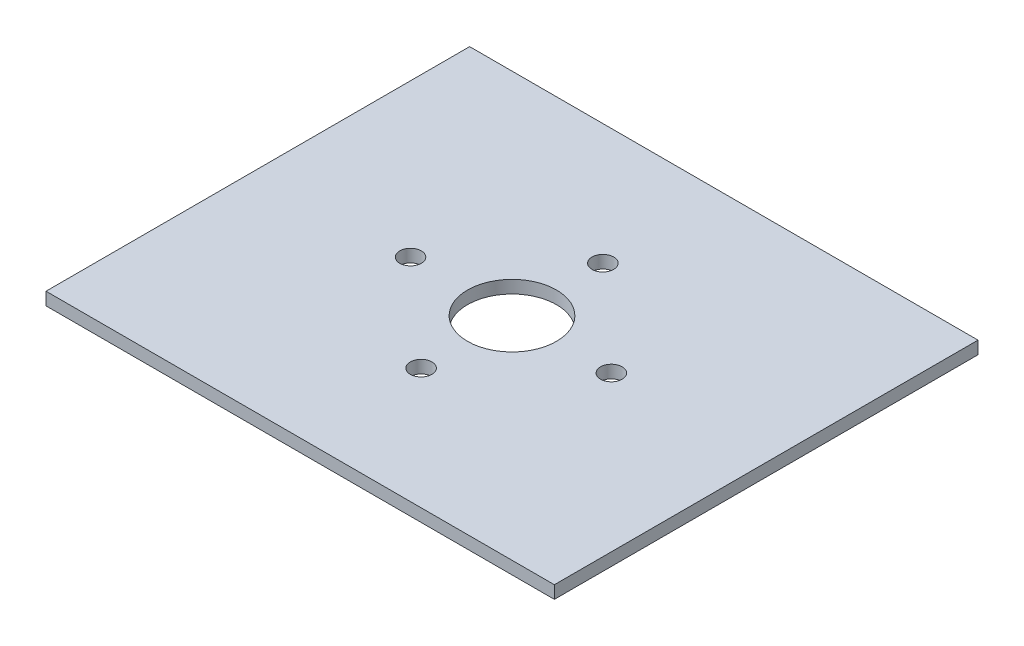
ISO-10303-21;
HEADER;
FILE_DESCRIPTION(('STEP AP214'),'2;1');
FILE_NAME('part.step','',(''),(''),'','','');
FILE_SCHEMA(('AUTOMOTIVE_DESIGN { 1 0 10303 214 1 1 1 1 }'));
ENDSEC;
DATA;
#1=APPLICATION_CONTEXT('core data for automotive mechanical design processes');
#2=APPLICATION_PROTOCOL_DEFINITION('international standard','automotive_design',2000,#1);
#3=PRODUCT_CONTEXT('',#1,'mechanical');
#4=PRODUCT('Part','Part','',(#3));
#5=PRODUCT_RELATED_PRODUCT_CATEGORY('part','',(#4));
#6=PRODUCT_DEFINITION_FORMATION('','',#4);
#7=PRODUCT_DEFINITION_CONTEXT('part definition',#1,'design');
#8=PRODUCT_DEFINITION('design','',#6,#7);
#9=PRODUCT_DEFINITION_SHAPE('','',#8);
#10=(LENGTH_UNIT() NAMED_UNIT(*) SI_UNIT(.MILLI.,.METRE.));
#11=(NAMED_UNIT(*) PLANE_ANGLE_UNIT() SI_UNIT($,.RADIAN.));
#12=(NAMED_UNIT(*) SI_UNIT($,.STERADIAN.) SOLID_ANGLE_UNIT());
#13=UNCERTAINTY_MEASURE_WITH_UNIT(LENGTH_MEASURE(1.E-05),#10,'distance_accuracy_value','');
#14=(GEOMETRIC_REPRESENTATION_CONTEXT(3) GLOBAL_UNCERTAINTY_ASSIGNED_CONTEXT((#13)) GLOBAL_UNIT_ASSIGNED_CONTEXT((#10,
#11,#12)) REPRESENTATION_CONTEXT('',''));
#15=CARTESIAN_POINT('',(0.,0.,0.));
#16=DIRECTION('',(0.,0.,1.));
#17=DIRECTION('',(1.,0.,0.));
#18=AXIS2_PLACEMENT_3D('',#15,#16,#17);
#19=CARTESIAN_POINT('',(0.,3.,0.));
#20=DIRECTION('',(0.,-1.,0.));
#21=DIRECTION('',(0.,0.,-1.));
#22=AXIS2_PLACEMENT_3D('',#19,#20,#21);
#23=PLANE('',#22);
#24=CARTESIAN_POINT('',(60.,3.,50.));
#25=DIRECTION('',(0.,1.,0.));
#26=DIRECTION('',(0.,0.,1.));
#27=AXIS2_PLACEMENT_3D('',#24,#25,#26);
#28=CIRCLE('',#27,10.5);
#29=CARTESIAN_POINT('',(60.,3.,60.5));
#30=VERTEX_POINT('',#29);
#31=EDGE_CURVE('E168',#30,#30,#28,.T.);
#32=ORIENTED_EDGE('',*,*,#31,.F.);
#33=EDGE_LOOP('',(#32));
#34=FACE_BOUND('',#33,.T.);
#35=DIRECTION('',(-1.,0.,0.));
#36=VECTOR('',#35,1.);
#37=CARTESIAN_POINT('',(0.,3.,0.));
#38=LINE('',#37,#36);
#39=CARTESIAN_POINT('',(120.,3.,0.));
#40=VERTEX_POINT('',#39);
#41=CARTESIAN_POINT('',(0.,3.,0.));
#42=VERTEX_POINT('',#41);
#43=EDGE_CURVE('E98',#40,#42,#38,.T.);
#44=ORIENTED_EDGE('',*,*,#43,.T.);
#45=DIRECTION('',(0.,0.,1.));
#46=VECTOR('',#45,1.);
#47=CARTESIAN_POINT('',(0.,3.,0.));
#48=LINE('',#47,#46);
#49=CARTESIAN_POINT('',(0.,3.,100.));
#50=VERTEX_POINT('',#49);
#51=EDGE_CURVE('E93',#42,#50,#48,.T.);
#52=ORIENTED_EDGE('',*,*,#51,.T.);
#53=DIRECTION('',(1.,0.,0.));
#54=VECTOR('',#53,1.);
#55=CARTESIAN_POINT('',(0.,3.,100.));
#56=LINE('',#55,#54);
#57=CARTESIAN_POINT('',(120.,3.,100.));
#58=VERTEX_POINT('',#57);
#59=EDGE_CURVE('E96',#50,#58,#56,.T.);
#60=ORIENTED_EDGE('',*,*,#59,.T.);
#61=DIRECTION('',(0.,0.,-1.));
#62=VECTOR('',#61,1.);
#63=CARTESIAN_POINT('',(120.,3.,0.));
#64=LINE('',#63,#62);
#65=EDGE_CURVE('E63',#58,#40,#64,.T.);
#66=ORIENTED_EDGE('',*,*,#65,.T.);
#67=EDGE_LOOP('',(#44,#52,#60,#66));
#68=FACE_BOUND('',#67,.T.);
#69=CARTESIAN_POINT('',(36.05,3.,50.));
#70=DIRECTION('',(0.,1.,0.));
#71=DIRECTION('',(0.,0.,1.));
#72=AXIS2_PLACEMENT_3D('',#69,#70,#71);
#73=CIRCLE('',#72,2.55000000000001);
#74=CARTESIAN_POINT('',(36.05,3.,52.55));
#75=VERTEX_POINT('',#74);
#76=EDGE_CURVE('E118',#75,#75,#73,.T.);
#77=ORIENTED_EDGE('',*,*,#76,.F.);
#78=EDGE_LOOP('',(#77));
#79=FACE_BOUND('',#78,.T.);
#80=CARTESIAN_POINT('',(83.45,3.,50.));
#81=DIRECTION('',(0.,1.,0.));
#82=DIRECTION('',(0.,0.,1.));
#83=AXIS2_PLACEMENT_3D('',#80,#81,#82);
#84=CIRCLE('',#83,2.54999999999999);
#85=CARTESIAN_POINT('',(83.45,3.,52.55));
#86=VERTEX_POINT('',#85);
#87=EDGE_CURVE('E140',#86,#86,#84,.T.);
#88=ORIENTED_EDGE('',*,*,#87,.F.);
#89=EDGE_LOOP('',(#88));
#90=FACE_BOUND('',#89,.T.);
#91=CARTESIAN_POINT('',(60.,3.,28.55));
#92=DIRECTION('',(0.,1.,0.));
#93=DIRECTION('',(0.,0.,1.));
#94=AXIS2_PLACEMENT_3D('',#91,#92,#93);
#95=CIRCLE('',#94,2.54999999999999);
#96=CARTESIAN_POINT('',(60.,3.,31.1));
#97=VERTEX_POINT('',#96);
#98=EDGE_CURVE('E148',#97,#97,#95,.T.);
#99=ORIENTED_EDGE('',*,*,#98,.F.);
#100=EDGE_LOOP('',(#99));
#101=FACE_BOUND('',#100,.T.);
#102=CARTESIAN_POINT('',(60.,3.,71.45));
#103=DIRECTION('',(0.,1.,0.));
#104=DIRECTION('',(0.,0.,1.));
#105=AXIS2_PLACEMENT_3D('',#102,#103,#104);
#106=CIRCLE('',#105,2.55);
#107=CARTESIAN_POINT('',(60.,3.,74.));
#108=VERTEX_POINT('',#107);
#109=EDGE_CURVE('E156',#108,#108,#106,.T.);
#110=ORIENTED_EDGE('',*,*,#109,.F.);
#111=EDGE_LOOP('',(#110));
#112=FACE_BOUND('',#111,.T.);
#113=ADVANCED_FACE('F45',(#34,#68,#79,#90,#101,#112),#23,.F.);
#114=CARTESIAN_POINT('',(0.,0.,0.));
#115=DIRECTION('',(0.,-1.,0.));
#116=DIRECTION('',(0.,0.,-1.));
#117=AXIS2_PLACEMENT_3D('',#114,#115,#116);
#118=PLANE('',#117);
#119=CARTESIAN_POINT('',(60.,0.,50.));
#120=DIRECTION('',(0.,1.,0.));
#121=DIRECTION('',(0.,0.,1.));
#122=AXIS2_PLACEMENT_3D('',#119,#120,#121);
#123=CIRCLE('',#122,10.5);
#124=CARTESIAN_POINT('',(60.,0.,60.5));
#125=VERTEX_POINT('',#124);
#126=EDGE_CURVE('E164',#125,#125,#123,.T.);
#127=ORIENTED_EDGE('',*,*,#126,.T.);
#128=EDGE_LOOP('',(#127));
#129=FACE_BOUND('',#128,.T.);
#130=CARTESIAN_POINT('',(60.,0.,28.55));
#131=DIRECTION('',(0.,1.,0.));
#132=DIRECTION('',(0.,0.,1.));
#133=AXIS2_PLACEMENT_3D('',#130,#131,#132);
#134=CIRCLE('',#133,2.54999999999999);
#135=CARTESIAN_POINT('',(60.,0.,31.1));
#136=VERTEX_POINT('',#135);
#137=EDGE_CURVE('E152',#136,#136,#134,.T.);
#138=ORIENTED_EDGE('',*,*,#137,.T.);
#139=EDGE_LOOP('',(#138));
#140=FACE_BOUND('',#139,.T.);
#141=CARTESIAN_POINT('',(36.05,0.,50.));
#142=DIRECTION('',(0.,1.,0.));
#143=DIRECTION('',(0.,0.,1.));
#144=AXIS2_PLACEMENT_3D('',#141,#142,#143);
#145=CIRCLE('',#144,2.55000000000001);
#146=CARTESIAN_POINT('',(36.05,0.,52.55));
#147=VERTEX_POINT('',#146);
#148=EDGE_CURVE('E136',#147,#147,#145,.T.);
#149=ORIENTED_EDGE('',*,*,#148,.T.);
#150=EDGE_LOOP('',(#149));
#151=FACE_BOUND('',#150,.T.);
#152=DIRECTION('',(-1.,0.,0.));
#153=VECTOR('',#152,1.);
#154=CARTESIAN_POINT('',(0.,0.,0.));
#155=LINE('',#154,#153);
#156=CARTESIAN_POINT('',(120.,0.,0.));
#157=VERTEX_POINT('',#156);
#158=CARTESIAN_POINT('',(0.,0.,0.));
#159=VERTEX_POINT('',#158);
#160=EDGE_CURVE('E114',#157,#159,#155,.T.);
#161=ORIENTED_EDGE('',*,*,#160,.F.);
#162=DIRECTION('',(0.,0.,-1.));
#163=VECTOR('',#162,1.);
#164=CARTESIAN_POINT('',(120.,0.,0.));
#165=LINE('',#164,#163);
#166=CARTESIAN_POINT('',(120.,0.,100.));
#167=VERTEX_POINT('',#166);
#168=EDGE_CURVE('E86',#167,#157,#165,.T.);
#169=ORIENTED_EDGE('',*,*,#168,.F.);
#170=DIRECTION('',(1.,0.,0.));
#171=VECTOR('',#170,1.);
#172=CARTESIAN_POINT('',(0.,0.,100.));
#173=LINE('',#172,#171);
#174=CARTESIAN_POINT('',(0.,0.,100.));
#175=VERTEX_POINT('',#174);
#176=EDGE_CURVE('E80',#175,#167,#173,.T.);
#177=ORIENTED_EDGE('',*,*,#176,.F.);
#178=DIRECTION('',(0.,0.,1.));
#179=VECTOR('',#178,1.);
#180=CARTESIAN_POINT('',(0.,0.,0.));
#181=LINE('',#180,#179);
#182=EDGE_CURVE('E103',#159,#175,#181,.T.);
#183=ORIENTED_EDGE('',*,*,#182,.F.);
#184=EDGE_LOOP('',(#161,#169,#177,#183));
#185=FACE_BOUND('',#184,.T.);
#186=CARTESIAN_POINT('',(83.45,0.,50.));
#187=DIRECTION('',(0.,1.,0.));
#188=DIRECTION('',(0.,0.,1.));
#189=AXIS2_PLACEMENT_3D('',#186,#187,#188);
#190=CIRCLE('',#189,2.54999999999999);
#191=CARTESIAN_POINT('',(83.45,0.,52.55));
#192=VERTEX_POINT('',#191);
#193=EDGE_CURVE('E144',#192,#192,#190,.T.);
#194=ORIENTED_EDGE('',*,*,#193,.T.);
#195=EDGE_LOOP('',(#194));
#196=FACE_BOUND('',#195,.T.);
#197=CARTESIAN_POINT('',(60.,0.,71.45));
#198=DIRECTION('',(0.,1.,0.));
#199=DIRECTION('',(0.,0.,1.));
#200=AXIS2_PLACEMENT_3D('',#197,#198,#199);
#201=CIRCLE('',#200,2.55);
#202=CARTESIAN_POINT('',(60.,0.,74.));
#203=VERTEX_POINT('',#202);
#204=EDGE_CURVE('E160',#203,#203,#201,.T.);
#205=ORIENTED_EDGE('',*,*,#204,.T.);
#206=EDGE_LOOP('',(#205));
#207=FACE_BOUND('',#206,.T.);
#208=ADVANCED_FACE('F131',(#129,#140,#151,#185,#196,#207),#118,.T.);
#209=CARTESIAN_POINT('',(0.,3.,0.));
#210=DIRECTION('',(0.,0.,1.));
#211=DIRECTION('',(1.,0.,0.));
#212=AXIS2_PLACEMENT_3D('',#209,#210,#211);
#213=PLANE('',#212);
#214=ORIENTED_EDGE('',*,*,#160,.T.);
#215=DIRECTION('',(0.,-1.,0.));
#216=VECTOR('',#215,1.);
#217=CARTESIAN_POINT('',(0.,3.,0.));
#218=LINE('',#217,#216);
#219=EDGE_CURVE('E11',#42,#159,#218,.T.);
#220=ORIENTED_EDGE('',*,*,#219,.F.);
#221=ORIENTED_EDGE('',*,*,#43,.F.);
#222=DIRECTION('',(0.,-1.,0.));
#223=VECTOR('',#222,1.);
#224=CARTESIAN_POINT('',(120.,3.,0.));
#225=LINE('',#224,#223);
#226=EDGE_CURVE('E110',#40,#157,#225,.T.);
#227=ORIENTED_EDGE('',*,*,#226,.T.);
#228=EDGE_LOOP('',(#214,#220,#221,#227));
#229=FACE_BOUND('',#228,.T.);
#230=ADVANCED_FACE('F47',(#229),#213,.F.);
#231=CARTESIAN_POINT('',(0.,3.,0.));
#232=DIRECTION('',(1.,0.,0.));
#233=DIRECTION('',(0.,0.,-1.));
#234=AXIS2_PLACEMENT_3D('',#231,#232,#233);
#235=PLANE('',#234);
#236=ORIENTED_EDGE('',*,*,#182,.T.);
#237=DIRECTION('',(0.,-1.,0.));
#238=VECTOR('',#237,1.);
#239=CARTESIAN_POINT('',(0.,3.,100.));
#240=LINE('',#239,#238);
#241=EDGE_CURVE('E55',#50,#175,#240,.T.);
#242=ORIENTED_EDGE('',*,*,#241,.F.);
#243=ORIENTED_EDGE('',*,*,#51,.F.);
#244=ORIENTED_EDGE('',*,*,#219,.T.);
#245=EDGE_LOOP('',(#236,#242,#243,#244));
#246=FACE_BOUND('',#245,.T.);
#247=ADVANCED_FACE('F102',(#246),#235,.F.);
#248=CARTESIAN_POINT('',(0.,3.,100.));
#249=DIRECTION('',(0.,0.,-1.));
#250=DIRECTION('',(-1.,0.,0.));
#251=AXIS2_PLACEMENT_3D('',#248,#249,#250);
#252=PLANE('',#251);
#253=ORIENTED_EDGE('',*,*,#176,.T.);
#254=DIRECTION('',(0.,-1.,0.));
#255=VECTOR('',#254,1.);
#256=CARTESIAN_POINT('',(120.,3.,100.));
#257=LINE('',#256,#255);
#258=EDGE_CURVE('E105',#58,#167,#257,.T.);
#259=ORIENTED_EDGE('',*,*,#258,.F.);
#260=ORIENTED_EDGE('',*,*,#59,.F.);
#261=ORIENTED_EDGE('',*,*,#241,.T.);
#262=EDGE_LOOP('',(#253,#259,#260,#261));
#263=FACE_BOUND('',#262,.T.);
#264=ADVANCED_FACE('F106',(#263),#252,.F.);
#265=CARTESIAN_POINT('',(120.,3.,0.));
#266=DIRECTION('',(-1.,0.,0.));
#267=DIRECTION('',(0.,0.,1.));
#268=AXIS2_PLACEMENT_3D('',#265,#266,#267);
#269=PLANE('',#268);
#270=ORIENTED_EDGE('',*,*,#168,.T.);
#271=ORIENTED_EDGE('',*,*,#226,.F.);
#272=ORIENTED_EDGE('',*,*,#65,.F.);
#273=ORIENTED_EDGE('',*,*,#258,.T.);
#274=EDGE_LOOP('',(#270,#271,#272,#273));
#275=FACE_BOUND('',#274,.T.);
#276=ADVANCED_FACE('F128',(#275),#269,.F.);
#277=CARTESIAN_POINT('',(36.05,3.,50.));
#278=DIRECTION('',(0.,-1.,0.));
#279=DIRECTION('',(0.,0.,-1.));
#280=AXIS2_PLACEMENT_3D('',#277,#278,#279);
#281=CYLINDRICAL_SURFACE('',#280,2.55000000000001);
#282=ORIENTED_EDGE('',*,*,#76,.T.);
#283=EDGE_LOOP('',(#282));
#284=FACE_BOUND('',#283,.T.);
#285=ORIENTED_EDGE('',*,*,#148,.F.);
#286=EDGE_LOOP('',(#285));
#287=FACE_BOUND('',#286,.T.);
#288=ADVANCED_FACE('F193',(#284,#287),#281,.F.);
#289=CARTESIAN_POINT('',(83.45,3.,50.));
#290=DIRECTION('',(0.,-1.,0.));
#291=DIRECTION('',(0.,0.,-1.));
#292=AXIS2_PLACEMENT_3D('',#289,#290,#291);
#293=CYLINDRICAL_SURFACE('',#292,2.54999999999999);
#294=ORIENTED_EDGE('',*,*,#87,.T.);
#295=EDGE_LOOP('',(#294));
#296=FACE_BOUND('',#295,.T.);
#297=ORIENTED_EDGE('',*,*,#193,.F.);
#298=EDGE_LOOP('',(#297));
#299=FACE_BOUND('',#298,.T.);
#300=ADVANCED_FACE('F235',(#296,#299),#293,.F.);
#301=CARTESIAN_POINT('',(60.,3.,28.55));
#302=DIRECTION('',(0.,-1.,0.));
#303=DIRECTION('',(0.,0.,-1.));
#304=AXIS2_PLACEMENT_3D('',#301,#302,#303);
#305=CYLINDRICAL_SURFACE('',#304,2.54999999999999);
#306=ORIENTED_EDGE('',*,*,#98,.T.);
#307=EDGE_LOOP('',(#306));
#308=FACE_BOUND('',#307,.T.);
#309=ORIENTED_EDGE('',*,*,#137,.F.);
#310=EDGE_LOOP('',(#309));
#311=FACE_BOUND('',#310,.T.);
#312=ADVANCED_FACE('F244',(#308,#311),#305,.F.);
#313=CARTESIAN_POINT('',(60.,3.,71.45));
#314=DIRECTION('',(0.,-1.,0.));
#315=DIRECTION('',(0.,0.,-1.));
#316=AXIS2_PLACEMENT_3D('',#313,#314,#315);
#317=CYLINDRICAL_SURFACE('',#316,2.55);
#318=ORIENTED_EDGE('',*,*,#109,.T.);
#319=EDGE_LOOP('',(#318));
#320=FACE_BOUND('',#319,.T.);
#321=ORIENTED_EDGE('',*,*,#204,.F.);
#322=EDGE_LOOP('',(#321));
#323=FACE_BOUND('',#322,.T.);
#324=ADVANCED_FACE('F181',(#320,#323),#317,.F.);
#325=CARTESIAN_POINT('',(60.,0.,50.));
#326=DIRECTION('',(0.,1.,0.));
#327=DIRECTION('',(0.,0.,1.));
#328=AXIS2_PLACEMENT_3D('',#325,#326,#327);
#329=CYLINDRICAL_SURFACE('',#328,10.5);
#330=ORIENTED_EDGE('',*,*,#126,.F.);
#331=EDGE_LOOP('',(#330));
#332=FACE_BOUND('',#331,.T.);
#333=ORIENTED_EDGE('',*,*,#31,.T.);
#334=EDGE_LOOP('',(#333));
#335=FACE_BOUND('',#334,.T.);
#336=ADVANCED_FACE('F178',(#332,#335),#329,.F.);
#337=CLOSED_SHELL('',(#113,#208,#230,#247,#264,#276,#288,#300,#312,#324,#336));
#338=MANIFOLD_SOLID_BREP('B2',#337);
#339=ADVANCED_BREP_SHAPE_REPRESENTATION('',(#18,#338),#14);
#340=SHAPE_DEFINITION_REPRESENTATION(#9,#339);
ENDSEC;
END-ISO-10303-21;
